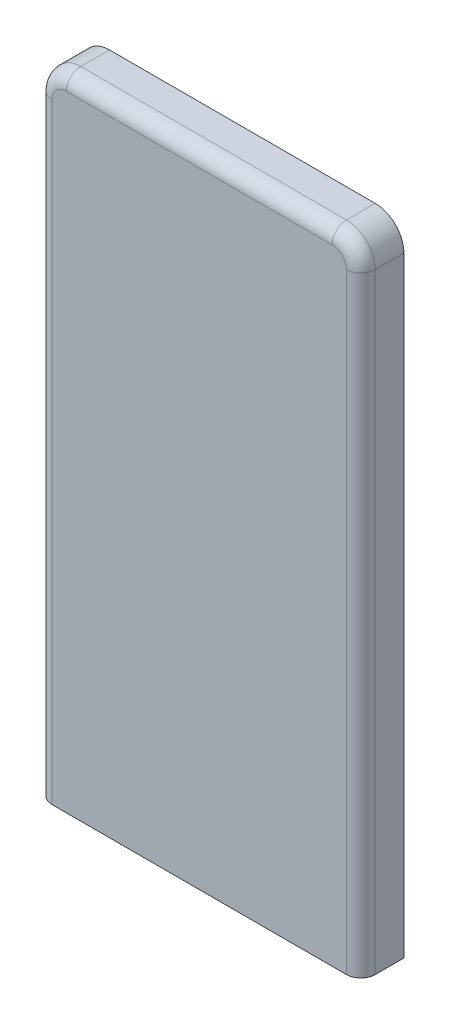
from build123d import *

# Parameters (mm, degrees)
SKETCH1_W          = 225
SKETCH1_H          = 445
BASE_EXTRUDE_DEPTH = 30
FILLET1_R          = 20
FILLET2_R          = 10
SHELL1_T           = -2


with BuildPart() as part:
    # Sketch1 → Base-Extrude (new body)
    with BuildSketch(Plane.XY):
        with Locations((0, -79)):
            Rectangle(SKETCH1_W, SKETCH1_H)
    extrude(amount=-BASE_EXTRUDE_DEPTH)

    # Fillet1
    fillet1_edges = [part.edges().sort_by_distance(p)[0] for p in [
        (-112.5, 143.5, -15),
        (112.5, 143.5, -15),
    ]]
    fillet(fillet1_edges, radius=FILLET1_R)

    # Fillet2
    fillet2_edges = [part.edges().sort_by_distance(p)[0] for p in [
        (-112.5, -89, 0),
        (0, 143.5, 0),
        (-106.642135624, 137.642135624, 0),
        (106.642135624, 137.642135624, 0),
        (112.5, -89, 0),
    ]]
    fillet(fillet2_edges, radius=FILLET2_R)

    # Shell1
    shell1_openings = [part.faces().sort_by_distance(p)[0] for p in [
        (0, -79.374496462, -30),
        (0, -301.5, -15.081695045),
    ]]
    offset(amount=SHELL1_T, openings=shell1_openings, kind=Kind.INTERSECTION)


solid = part.part
